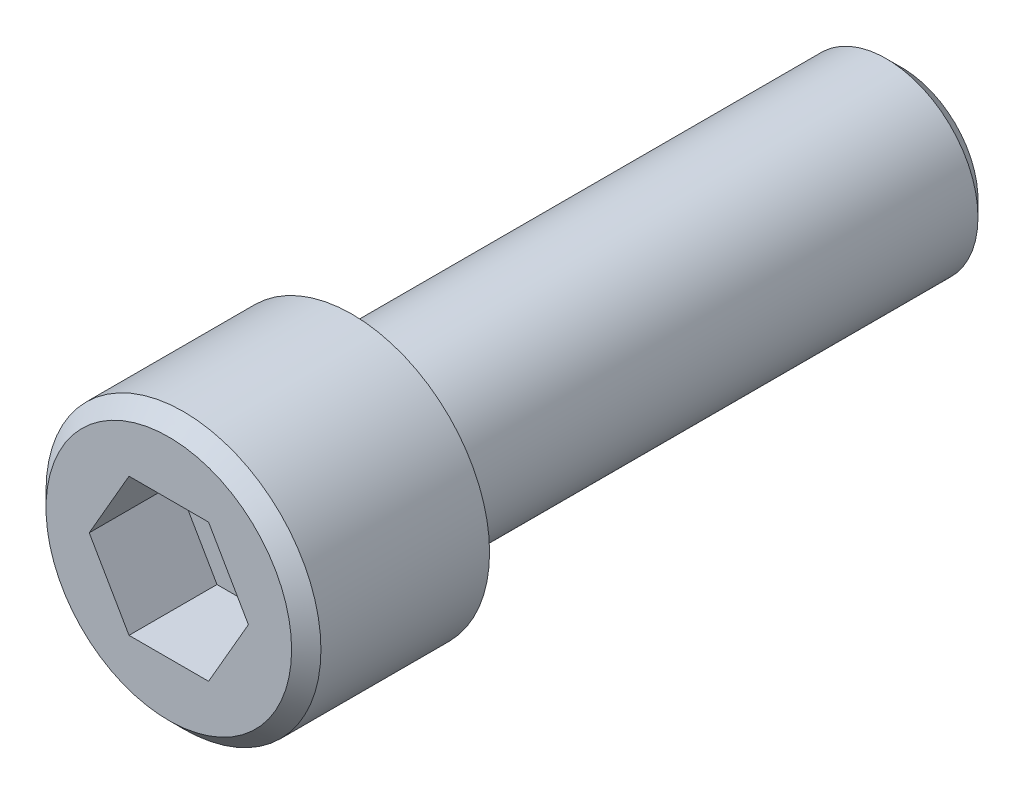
from build123d import *

# Parameters (mm, degrees)
SKETCH1_R           = 4.7625
BOSS_EXTRUDE1_DEPTH = 6.35
CHAMFER1_SIZE       = 0.508
CUT_EXTRUDE1_DEPTH  = 3.048
SKETCH4_R           = 3.175
BOSS_EXTRUDE2_DEPTH = 19.05
SKETCH5_OUTSIDE_W   = 55.376
SKETCH5_OUTSIDE_H   = 55.376
SKETCH5_OUTSIDE_R   = 2.633702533
CUT_EXTRUDE3_DEPTH  = 19.05
CUT_EXTRUDE3_DRAFT  = -45


with BuildPart() as part:
    # Sketch1 → Boss-Extrude1 (new body)
    with BuildSketch(Plane.XY):
        Circle(SKETCH1_R)
    extrude(amount=BOSS_EXTRUDE1_DEPTH)

    # Chamfer1
    chamfer1_edges = [part.edges().sort_by_distance(p)[0] for p in [
        (-4.7625, 0, 6.35),
    ]]
    chamfer(chamfer1_edges, length=CHAMFER1_SIZE)

    # Sketch2 → Cut-Extrude1 (cut)
    with BuildSketch(Plane.XY.offset(6.35)):
        Polygon((-2.756963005, 0), (-1.378481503, -2.3876), (1.378481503, -2.3876), (2.756963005, 0), (1.378481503, 2.3876), (-1.378481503, 2.3876), align=None)
    extrude(amount=-CUT_EXTRUDE1_DEPTH, mode=Mode.SUBTRACT)

    # Sketch4 → Boss-Extrude2 (add)
    with BuildSketch(Plane(origin=(0, 0, 0), x_dir=(-1, 0, 0), z_dir=(0, 0, -1))):
        with Locations(Location((0, 0, 0), (0, 0, 180))):
            Circle(SKETCH4_R)
    extrude(amount=BOSS_EXTRUDE2_DEPTH)


with BuildPart() as cut_extrude3_tool:
    # Sketch5 outside → Cut-Extrude3 (with draft: the straight prism first)
    with BuildSketch(Plane(origin=(0, 0, -19.05), x_dir=(-1, 0, 0), z_dir=(0, 0, -1))):
        Rectangle(SKETCH5_OUTSIDE_W, SKETCH5_OUTSIDE_H)
        Circle(SKETCH5_OUTSIDE_R, mode=Mode.SUBTRACT)
    extrude(amount=-CUT_EXTRUDE3_DEPTH)
    # Cut-Extrude3: the draft: its side faces are tilted about the plane it starts from
    cut_extrude3_sides = [cut_extrude3_tool.faces().sort_by_distance(p)[0] for p in [
        (0, -27.688, -9.525),
        (-27.688, 0, -9.525),
        (0, 27.688, -9.525),
        (27.688, 0, -9.525),
        (2.633702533, 0, -9.525),
    ]]
    draft(cut_extrude3_sides, Plane(origin=(0, 0, -19.05), x_dir=(-1, 0, 0), z_dir=(0, 0, -1)), CUT_EXTRUDE3_DRAFT)


with BuildPart() as part_1:
    add(part.part)

    # Cut-Extrude3: cut by cut_extrude3_tool
    add(cut_extrude3_tool.part, mode=Mode.SUBTRACT)


solid = part_1.part
